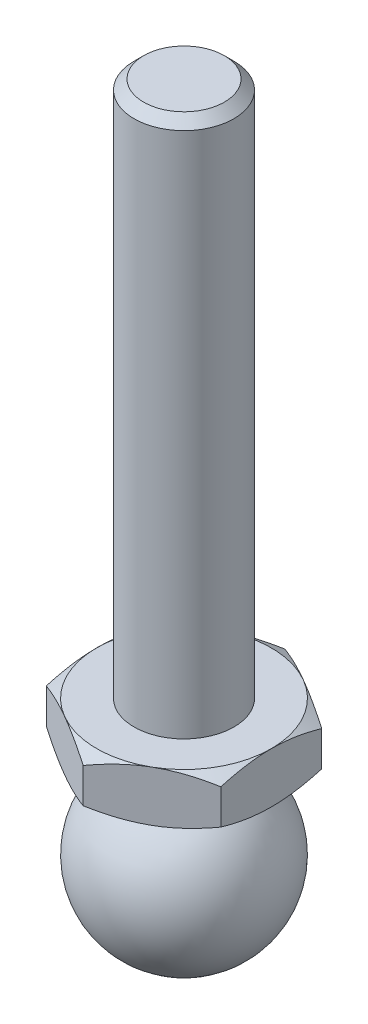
ISO-10303-21;
HEADER;
FILE_DESCRIPTION(('STEP AP214'),'2;1');
FILE_NAME('part.step','',(''),(''),'','','');
FILE_SCHEMA(('AUTOMOTIVE_DESIGN { 1 0 10303 214 1 1 1 1 }'));
ENDSEC;
DATA;
#1=APPLICATION_CONTEXT('core data for automotive mechanical design processes');
#2=APPLICATION_PROTOCOL_DEFINITION('international standard','automotive_design',2000,#1);
#3=PRODUCT_CONTEXT('',#1,'mechanical');
#4=PRODUCT('Part','Part','',(#3));
#5=PRODUCT_RELATED_PRODUCT_CATEGORY('part','',(#4));
#6=PRODUCT_DEFINITION_FORMATION('','',#4);
#7=PRODUCT_DEFINITION_CONTEXT('part definition',#1,'design');
#8=PRODUCT_DEFINITION('design','',#6,#7);
#9=PRODUCT_DEFINITION_SHAPE('','',#8);
#10=(LENGTH_UNIT() NAMED_UNIT(*) SI_UNIT(.MILLI.,.METRE.));
#11=(NAMED_UNIT(*) PLANE_ANGLE_UNIT() SI_UNIT($,.RADIAN.));
#12=(NAMED_UNIT(*) SI_UNIT($,.STERADIAN.) SOLID_ANGLE_UNIT());
#13=UNCERTAINTY_MEASURE_WITH_UNIT(LENGTH_MEASURE(1.E-05),#10,'distance_accuracy_value','');
#14=(GEOMETRIC_REPRESENTATION_CONTEXT(3) GLOBAL_UNCERTAINTY_ASSIGNED_CONTEXT((#13)) GLOBAL_UNIT_ASSIGNED_CONTEXT((#10,
#11,#12)) REPRESENTATION_CONTEXT('',''));
#15=CARTESIAN_POINT('',(0.,0.,0.));
#16=DIRECTION('',(0.,0.,1.));
#17=DIRECTION('',(1.,0.,0.));
#18=AXIS2_PLACEMENT_3D('',#15,#16,#17);
#19=CARTESIAN_POINT('',(0.,10.85,0.));
#20=DIRECTION('',(0.,-1.,0.));
#21=DIRECTION('',(0.,0.,-1.));
#22=AXIS2_PLACEMENT_3D('',#19,#20,#21);
#23=CONICAL_SURFACE('',#22,7.,1.0471975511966);
#24=CARTESIAN_POINT('',(-7.,6.7882826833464,12.1648696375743));
#25=CARTESIAN_POINT('',(-7.,6.93391573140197,11.8738003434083));
#26=CARTESIAN_POINT('',(-7.,7.07854589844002,11.5822239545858));
#27=CARTESIAN_POINT('',(-7.,7.36531569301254,10.997825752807));
#28=CARTESIAN_POINT('',(-7.,7.50745515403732,10.7050038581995));
#29=CARTESIAN_POINT('',(-7.,7.78902214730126,10.117331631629));
#30=CARTESIAN_POINT('',(-7.,7.92844364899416,9.82247840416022));
#31=CARTESIAN_POINT('',(-7.,8.20360604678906,9.23106328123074));
#32=CARTESIAN_POINT('',(-7.,8.33934701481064,8.93450141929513));
#33=CARTESIAN_POINT('',(-7.,8.61231104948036,8.32593520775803));
#34=CARTESIAN_POINT('',(-7.,8.74932547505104,8.01383696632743));
#35=CARTESIAN_POINT('',(-7.,9.01713837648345,7.38695797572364));
#36=CARTESIAN_POINT('',(-7.,9.14793657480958,7.07217710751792));
#37=CARTESIAN_POINT('',(-7.,9.4015530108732,6.4396244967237));
#38=CARTESIAN_POINT('',(-7.,9.52437615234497,6.12185473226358));
#39=CARTESIAN_POINT('',(-7.,9.75990162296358,5.48260317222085));
#40=CARTESIAN_POINT('',(-7.,9.87260505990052,5.16112178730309));
#41=CARTESIAN_POINT('',(-7.,10.1099014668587,4.43821731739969));
#42=CARTESIAN_POINT('',(-7.,10.2311181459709,4.03566892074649));
#43=CARTESIAN_POINT('',(-7.,10.4469740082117,3.22331060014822));
#44=CARTESIAN_POINT('',(-7.,10.5416155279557,2.81350131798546));
#45=CARTESIAN_POINT('',(-7.,10.6569999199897,2.19742561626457));
#46=CARTESIAN_POINT('',(-7.,10.6908518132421,1.99359214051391));
#47=CARTESIAN_POINT('',(-7.,10.7493191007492,1.58461613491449));
#48=CARTESIAN_POINT('',(-7.,10.7739358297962,1.37947379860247));
#49=CARTESIAN_POINT('',(-7.,10.8131968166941,0.96828958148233));
#50=CARTESIAN_POINT('',(-7.,10.8278439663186,0.762247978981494));
#51=CARTESIAN_POINT('',(-7.,10.8467021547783,0.349683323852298));
#52=CARTESIAN_POINT('',(-7.,10.8509132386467,0.143160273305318));
#53=CARTESIAN_POINT('',(-7.,10.8487493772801,-0.271082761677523));
#54=CARTESIAN_POINT('',(-7.,10.8423100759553,-0.478802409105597));
#55=CARTESIAN_POINT('',(-7.,10.8189433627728,-0.893645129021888));
#56=CARTESIAN_POINT('',(-7.,10.8020159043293,-1.10076819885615));
#57=CARTESIAN_POINT('',(-7.,10.7582124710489,-1.514030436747));
#58=CARTESIAN_POINT('',(-7.,10.7313327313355,-1.72016920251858));
#59=CARTESIAN_POINT('',(-7.,10.6684180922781,-2.13103319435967));
#60=CARTESIAN_POINT('',(-7.,10.6323828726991,-2.33575837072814));
#61=CARTESIAN_POINT('',(-7.,10.5105686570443,-2.95437912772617));
#62=CARTESIAN_POINT('',(-7.,10.4118729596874,-3.36575077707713));
#63=CARTESIAN_POINT('',(-7.,10.1884533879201,-4.18138012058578));
#64=CARTESIAN_POINT('',(-7.,10.0637148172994,-4.58563365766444));
#65=CARTESIAN_POINT('',(-7.,9.82332483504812,-5.30320893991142));
#66=CARTESIAN_POINT('',(-7.,9.71128759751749,-5.617759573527));
#67=CARTESIAN_POINT('',(-7.,9.47785144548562,-6.24325021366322));
#68=CARTESIAN_POINT('',(-7.,9.35645511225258,-6.55419118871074));
#69=CARTESIAN_POINT('',(-7.,9.10620704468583,-7.17328528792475));
#70=CARTESIAN_POINT('',(-7.,8.97735033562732,-7.48143638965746));
#71=CARTESIAN_POINT('',(-7.,8.71378231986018,-8.09523802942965));
#72=CARTESIAN_POINT('',(-7.,8.57907065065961,-8.40088841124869));
#73=CARTESIAN_POINT('',(-7.,8.31078407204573,-8.99716345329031));
#74=CARTESIAN_POINT('',(-7.,8.17740317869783,-9.28787568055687));
#75=CARTESIAN_POINT('',(-7.,7.90714715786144,-9.86766295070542));
#76=CARTESIAN_POINT('',(-7.,7.77027208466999,-10.1567380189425));
#77=CARTESIAN_POINT('',(-7.,7.49389786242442,-10.7329937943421));
#78=CARTESIAN_POINT('',(-7.,7.35440383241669,-11.0201769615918));
#79=CARTESIAN_POINT('',(-7.,7.07302286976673,-11.5933594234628));
#80=CARTESIAN_POINT('',(-7.,6.93113600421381,-11.879358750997));
#81=CARTESIAN_POINT('',(-7.,6.7882826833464,-12.1648696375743));
#82=B_SPLINE_CURVE_WITH_KNOTS('',3,(#24,#25,#26,#27,#28,#29,#30,#31,#32,#33,#34,#35,#36,#37,#38,
#39,#40,#41,#42,#43,#44,#45,#46,#47,#48,#49,#50,#51,#52,#53,#54,#55,#56,#57,#58,#59,#60,#61,#62,
#63,#64,#65,#66,#67,#68,#69,#70,#71,#72,#73,#74,#75,#76,#77,#78,#79,#80,#81),.UNSPECIFIED.,.F.,
.F.,(4,2,2,2,2,2,2,2,2,2,2,2,2,2,2,2,2,2,2,2,2,2,2,2,2,2,2,2,4),(0.,0.976413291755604,
1.95289161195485,2.93133423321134,3.90975772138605,4.93225217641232,5.95479223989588,
6.97669748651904,7.99849072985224,9.25906449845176,10.5195273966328,11.1392271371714,
11.7588372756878,12.3782676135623,12.9976952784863,13.6208795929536,14.2440666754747,
14.8674897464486,15.4909346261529,16.7587972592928,18.0273773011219,19.0289263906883,
20.0302002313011,21.0321496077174,22.0341611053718,22.9936838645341,23.9531917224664,
24.9109871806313,25.8687558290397),.UNSPECIFIED.);
#83=CARTESIAN_POINT('',(-7.,10.2247852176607,4.04145188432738));
#84=VERTEX_POINT('',#83);
#85=CARTESIAN_POINT('',(-7.,10.85,0.));
#86=VERTEX_POINT('',#85);
#87=EDGE_CURVE('E309',#84,#86,#82,.T.);
#88=ORIENTED_EDGE('',*,*,#87,.F.);
#89=CARTESIAN_POINT('',(0.00020000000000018,10.2247185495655,8.0830192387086));
#90=CARTESIAN_POINT('',(-0.153667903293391,10.2760001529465,7.99418356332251));
#91=CARTESIAN_POINT('',(-0.30810950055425,10.3249544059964,7.90501666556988));
#92=CARTESIAN_POINT('',(-0.618246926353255,10.4175672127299,7.72595873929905));
#93=CARTESIAN_POINT('',(-0.773943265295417,10.4612234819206,7.63606741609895));
#94=CARTESIAN_POINT('',(-1.24352516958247,10.5833884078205,7.36495417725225));
#95=CARTESIAN_POINT('',(-1.5592643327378,10.652874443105,7.18266208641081));
#96=CARTESIAN_POINT('',(-2.03176224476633,10.7343550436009,6.9098652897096));
#97=CARTESIAN_POINT('',(-2.18710922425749,10.7575665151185,6.82017566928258));
#98=CARTESIAN_POINT('',(-2.49850511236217,10.7964887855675,6.64039116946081));
#99=CARTESIAN_POINT('',(-2.65455395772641,10.8122002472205,6.55029632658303));
#100=CARTESIAN_POINT('',(-2.96692267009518,10.8357220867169,6.3699501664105));
#101=CARTESIAN_POINT('',(-3.12324202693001,10.8435414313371,6.27969914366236));
#102=CARTESIAN_POINT('',(-3.43601650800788,10.8511197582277,6.09911871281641));
#103=CARTESIAN_POINT('',(-3.59247162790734,10.850878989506,6.00878930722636));
#104=CARTESIAN_POINT('',(-4.02110687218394,10.8391402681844,5.76131663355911));
#105=CARTESIAN_POINT('',(-4.2931466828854,10.8194342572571,5.60425437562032));
#106=CARTESIAN_POINT('',(-4.8354194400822,10.7569465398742,5.29117305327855));
#107=CARTESIAN_POINT('',(-5.10565047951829,10.714143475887,5.13515508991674));
#108=CARTESIAN_POINT('',(-5.64901454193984,10.6071483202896,4.82144370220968));
#109=CARTESIAN_POINT('',(-5.92207900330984,10.5425029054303,4.66378986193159));
#110=CARTESIAN_POINT('',(-6.46413578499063,10.395783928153,4.35083323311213));
#111=CARTESIAN_POINT('',(-6.73313504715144,10.3137448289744,4.19552643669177));
#112=CARTESIAN_POINT('',(-7.0002,10.2247185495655,4.04133641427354));
#113=B_SPLINE_CURVE_WITH_KNOTS('',3,(#89,#90,#91,#92,#93,#94,#95,#96,#97,#98,#99,#100,#101,#102,
#103,#104,#105,#106,#107,#108,#109,#110,#111,#112),.UNSPECIFIED.,.F.,.F.,(4,2,2,2,2,2,2,2,2,2,2,
4),(0.,0.554727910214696,1.10969417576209,2.2219327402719,2.76443041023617,3.30688013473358,
3.84871284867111,4.3905288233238,5.33376515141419,6.27787517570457,7.2429241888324,
8.20607866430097),.UNSPECIFIED.);
#114=CARTESIAN_POINT('',(-3.5,10.85,6.06217782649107));
#115=VERTEX_POINT('',#114);
#116=EDGE_CURVE('E135',#115,#84,#113,.T.);
#117=ORIENTED_EDGE('',*,*,#116,.F.);
#118=CARTESIAN_POINT('',(0.,10.85,0.));
#119=DIRECTION('',(0.,-1.,0.));
#120=DIRECTION('',(0.,0.,-1.));
#121=AXIS2_PLACEMENT_3D('',#118,#119,#120);
#122=CIRCLE('',#121,7.);
#123=EDGE_CURVE('E283',#115,#86,#122,.T.);
#124=ORIENTED_EDGE('',*,*,#123,.T.);
#125=EDGE_LOOP('',(#88,#117,#124));
#126=FACE_BOUND('',#125,.T.);
#127=ADVANCED_FACE('F14',(#126),#23,.T.);
#128=CARTESIAN_POINT('',(-7.,10.2247852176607,-4.04145188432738));
#129=VERTEX_POINT('',#128);
#130=EDGE_CURVE('E193',#86,#129,#82,.T.);
#131=ORIENTED_EDGE('',*,*,#130,.F.);
#132=CARTESIAN_POINT('',(-3.5,10.85,-6.06217782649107));
#133=VERTEX_POINT('',#132);
#134=EDGE_CURVE('E195',#86,#133,#122,.T.);
#135=ORIENTED_EDGE('',*,*,#134,.T.);
#136=CARTESIAN_POINT('',(-7.0002,10.2247185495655,-4.04133641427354));
#137=CARTESIAN_POINT('',(-6.84633209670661,10.2760001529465,-4.13017208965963));
#138=CARTESIAN_POINT('',(-6.69189049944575,10.3249544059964,-4.21933898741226));
#139=CARTESIAN_POINT('',(-6.38175307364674,10.4175672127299,-4.39839691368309));
#140=CARTESIAN_POINT('',(-6.22605673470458,10.4612234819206,-4.48828823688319));
#141=CARTESIAN_POINT('',(-5.75647483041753,10.5833884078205,-4.75940147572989));
#142=CARTESIAN_POINT('',(-5.44073566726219,10.652874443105,-4.94169356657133));
#143=CARTESIAN_POINT('',(-4.96823775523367,10.7343550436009,-5.21449036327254));
#144=CARTESIAN_POINT('',(-4.81289077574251,10.7575665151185,-5.30417998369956));
#145=CARTESIAN_POINT('',(-4.50149488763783,10.7964887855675,-5.48396448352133));
#146=CARTESIAN_POINT('',(-4.34544604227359,10.8122002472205,-5.57405932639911));
#147=CARTESIAN_POINT('',(-4.03307732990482,10.8357220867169,-5.75440548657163));
#148=CARTESIAN_POINT('',(-3.87675797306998,10.8435414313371,-5.84465650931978));
#149=CARTESIAN_POINT('',(-3.56398349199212,10.8511197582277,-6.02523694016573));
#150=CARTESIAN_POINT('',(-3.40752837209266,10.850878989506,-6.11556634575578));
#151=CARTESIAN_POINT('',(-2.97889312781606,10.8391402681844,-6.36303901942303));
#152=CARTESIAN_POINT('',(-2.70685331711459,10.8194342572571,-6.52010127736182));
#153=CARTESIAN_POINT('',(-2.1645805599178,10.7569465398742,-6.83318259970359));
#154=CARTESIAN_POINT('',(-1.89434952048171,10.714143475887,-6.9892005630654));
#155=CARTESIAN_POINT('',(-1.35098545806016,10.6071483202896,-7.30291195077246));
#156=CARTESIAN_POINT('',(-1.07792099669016,10.5425029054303,-7.46056579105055));
#157=CARTESIAN_POINT('',(-0.535864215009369,10.395783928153,-7.77352241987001));
#158=CARTESIAN_POINT('',(-0.266864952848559,10.3137448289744,-7.92882921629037));
#159=CARTESIAN_POINT('',(0.000200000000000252,10.2247185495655,-8.0830192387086));
#160=B_SPLINE_CURVE_WITH_KNOTS('',3,(#136,#137,#138,#139,#140,#141,#142,#143,#144,#145,#146,
#147,#148,#149,#150,#151,#152,#153,#154,#155,#156,#157,#158,#159),.UNSPECIFIED.,.F.,.F.,(4,2,2,
2,2,2,2,2,2,2,2,4),(0.,0.554727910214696,1.10969417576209,2.2219327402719,2.76443041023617,
3.30688013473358,3.8487128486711,4.3905288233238,5.33376515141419,6.27787517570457,
7.2429241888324,8.20607866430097),.UNSPECIFIED.);
#161=EDGE_CURVE('E183',#129,#133,#160,.T.);
#162=ORIENTED_EDGE('',*,*,#161,.F.);
#163=EDGE_LOOP('',(#131,#135,#162));
#164=FACE_BOUND('',#163,.T.);
#165=ADVANCED_FACE('F192',(#164),#23,.T.);
#166=CARTESIAN_POINT('',(0.,10.2247852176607,-8.08290376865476));
#167=VERTEX_POINT('',#166);
#168=EDGE_CURVE('E197',#133,#167,#160,.T.);
#169=ORIENTED_EDGE('',*,*,#168,.F.);
#170=CARTESIAN_POINT('',(3.5,10.85,-6.06217782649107));
#171=VERTEX_POINT('',#170);
#172=EDGE_CURVE('E293',#133,#171,#122,.T.);
#173=ORIENTED_EDGE('',*,*,#172,.T.);
#174=CARTESIAN_POINT('',(-0.00020000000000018,10.2247185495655,-8.0830192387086));
#175=CARTESIAN_POINT('',(0.153667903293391,10.2760001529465,-7.99418356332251));
#176=CARTESIAN_POINT('',(0.30810950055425,10.3249544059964,-7.90501666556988));
#177=CARTESIAN_POINT('',(0.618246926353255,10.4175672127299,-7.72595873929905));
#178=CARTESIAN_POINT('',(0.773943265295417,10.4612234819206,-7.63606741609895));
#179=CARTESIAN_POINT('',(1.24352516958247,10.5833884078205,-7.36495417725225));
#180=CARTESIAN_POINT('',(1.5592643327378,10.652874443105,-7.18266208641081));
#181=CARTESIAN_POINT('',(2.03176224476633,10.7343550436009,-6.9098652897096));
#182=CARTESIAN_POINT('',(2.18710922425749,10.7575665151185,-6.82017566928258));
#183=CARTESIAN_POINT('',(2.49850511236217,10.7964887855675,-6.64039116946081));
#184=CARTESIAN_POINT('',(2.65455395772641,10.8122002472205,-6.55029632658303));
#185=CARTESIAN_POINT('',(2.96692267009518,10.8357220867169,-6.3699501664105));
#186=CARTESIAN_POINT('',(3.12324202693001,10.8435414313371,-6.27969914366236));
#187=CARTESIAN_POINT('',(3.43601650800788,10.8511197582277,-6.09911871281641));
#188=CARTESIAN_POINT('',(3.59247162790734,10.850878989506,-6.00878930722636));
#189=CARTESIAN_POINT('',(4.02110687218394,10.8391402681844,-5.76131663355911));
#190=CARTESIAN_POINT('',(4.2931466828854,10.8194342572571,-5.60425437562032));
#191=CARTESIAN_POINT('',(4.8354194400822,10.7569465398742,-5.29117305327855));
#192=CARTESIAN_POINT('',(5.10565047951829,10.714143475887,-5.13515508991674));
#193=CARTESIAN_POINT('',(5.64901454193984,10.6071483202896,-4.82144370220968));
#194=CARTESIAN_POINT('',(5.92207900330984,10.5425029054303,-4.66378986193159));
#195=CARTESIAN_POINT('',(6.46413578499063,10.395783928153,-4.35083323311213));
#196=CARTESIAN_POINT('',(6.73313504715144,10.3137448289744,-4.19552643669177));
#197=CARTESIAN_POINT('',(7.0002,10.2247185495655,-4.04133641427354));
#198=B_SPLINE_CURVE_WITH_KNOTS('',3,(#174,#175,#176,#177,#178,#179,#180,#181,#182,#183,#184,
#185,#186,#187,#188,#189,#190,#191,#192,#193,#194,#195,#196,#197),.UNSPECIFIED.,.F.,.F.,(4,2,2,
2,2,2,2,2,2,2,2,4),(0.,0.554727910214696,1.10969417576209,2.2219327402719,2.76443041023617,
3.30688013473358,3.84871284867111,4.3905288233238,5.33376515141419,6.27787517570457,
7.2429241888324,8.20607866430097),.UNSPECIFIED.);
#199=EDGE_CURVE('E243',#167,#171,#198,.T.);
#200=ORIENTED_EDGE('',*,*,#199,.F.);
#201=EDGE_LOOP('',(#169,#173,#200));
#202=FACE_BOUND('',#201,.T.);
#203=ADVANCED_FACE('F342',(#202),#23,.T.);
#204=CARTESIAN_POINT('',(7.,10.2247852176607,-4.04145188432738));
#205=VERTEX_POINT('',#204);
#206=EDGE_CURVE('E238',#171,#205,#198,.T.);
#207=ORIENTED_EDGE('',*,*,#206,.F.);
#208=CARTESIAN_POINT('',(7.,10.85,0.));
#209=VERTEX_POINT('',#208);
#210=EDGE_CURVE('E288',#171,#209,#122,.T.);
#211=ORIENTED_EDGE('',*,*,#210,.T.);
#212=CARTESIAN_POINT('',(7.,6.7882826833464,-12.1648696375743));
#213=CARTESIAN_POINT('',(7.,6.93391573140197,-11.8738003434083));
#214=CARTESIAN_POINT('',(7.,7.07854589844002,-11.5822239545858));
#215=CARTESIAN_POINT('',(7.,7.36531569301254,-10.997825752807));
#216=CARTESIAN_POINT('',(7.,7.50745515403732,-10.7050038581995));
#217=CARTESIAN_POINT('',(7.,7.78902214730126,-10.117331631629));
#218=CARTESIAN_POINT('',(7.,7.92844364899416,-9.82247840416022));
#219=CARTESIAN_POINT('',(7.,8.20360604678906,-9.23106328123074));
#220=CARTESIAN_POINT('',(7.,8.33934701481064,-8.93450141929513));
#221=CARTESIAN_POINT('',(7.,8.61231104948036,-8.32593520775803));
#222=CARTESIAN_POINT('',(7.,8.74932547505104,-8.01383696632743));
#223=CARTESIAN_POINT('',(7.,9.01713837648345,-7.38695797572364));
#224=CARTESIAN_POINT('',(7.,9.14793657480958,-7.07217710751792));
#225=CARTESIAN_POINT('',(7.,9.4015530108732,-6.4396244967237));
#226=CARTESIAN_POINT('',(7.,9.52437615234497,-6.12185473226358));
#227=CARTESIAN_POINT('',(7.,9.75990162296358,-5.48260317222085));
#228=CARTESIAN_POINT('',(7.,9.87260505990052,-5.16112178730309));
#229=CARTESIAN_POINT('',(7.,10.1099014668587,-4.43821731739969));
#230=CARTESIAN_POINT('',(7.,10.2311181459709,-4.03566892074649));
#231=CARTESIAN_POINT('',(7.,10.4469740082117,-3.22331060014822));
#232=CARTESIAN_POINT('',(7.,10.5416155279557,-2.81350131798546));
#233=CARTESIAN_POINT('',(7.,10.6569999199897,-2.19742561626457));
#234=CARTESIAN_POINT('',(7.,10.6908518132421,-1.99359214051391));
#235=CARTESIAN_POINT('',(7.,10.7493191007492,-1.58461613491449));
#236=CARTESIAN_POINT('',(7.,10.7739358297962,-1.37947379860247));
#237=CARTESIAN_POINT('',(7.,10.8131968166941,-0.96828958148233));
#238=CARTESIAN_POINT('',(7.,10.8278439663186,-0.762247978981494));
#239=CARTESIAN_POINT('',(7.,10.8467021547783,-0.349683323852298));
#240=CARTESIAN_POINT('',(7.,10.8509132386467,-0.143160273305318));
#241=CARTESIAN_POINT('',(7.,10.8487493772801,0.271082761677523));
#242=CARTESIAN_POINT('',(7.,10.8423100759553,0.478802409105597));
#243=CARTESIAN_POINT('',(7.,10.8189433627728,0.893645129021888));
#244=CARTESIAN_POINT('',(7.,10.8020159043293,1.10076819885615));
#245=CARTESIAN_POINT('',(7.,10.7582124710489,1.514030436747));
#246=CARTESIAN_POINT('',(7.,10.7313327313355,1.72016920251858));
#247=CARTESIAN_POINT('',(7.,10.6684180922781,2.13103319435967));
#248=CARTESIAN_POINT('',(7.,10.6323828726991,2.33575837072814));
#249=CARTESIAN_POINT('',(7.,10.5105686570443,2.95437912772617));
#250=CARTESIAN_POINT('',(7.,10.4118729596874,3.36575077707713));
#251=CARTESIAN_POINT('',(7.,10.1884533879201,4.18138012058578));
#252=CARTESIAN_POINT('',(7.,10.0637148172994,4.58563365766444));
#253=CARTESIAN_POINT('',(7.,9.82332483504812,5.30320893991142));
#254=CARTESIAN_POINT('',(7.,9.71128759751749,5.617759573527));
#255=CARTESIAN_POINT('',(7.,9.47785144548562,6.24325021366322));
#256=CARTESIAN_POINT('',(7.,9.35645511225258,6.55419118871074));
#257=CARTESIAN_POINT('',(7.,9.10620704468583,7.17328528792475));
#258=CARTESIAN_POINT('',(7.,8.97735033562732,7.48143638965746));
#259=CARTESIAN_POINT('',(7.,8.71378231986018,8.09523802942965));
#260=CARTESIAN_POINT('',(7.,8.57907065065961,8.40088841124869));
#261=CARTESIAN_POINT('',(7.,8.31078407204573,8.99716345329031));
#262=CARTESIAN_POINT('',(7.,8.17740317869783,9.28787568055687));
#263=CARTESIAN_POINT('',(7.,7.90714715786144,9.86766295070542));
#264=CARTESIAN_POINT('',(7.,7.77027208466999,10.1567380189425));
#265=CARTESIAN_POINT('',(7.,7.49389786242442,10.7329937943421));
#266=CARTESIAN_POINT('',(7.,7.35440383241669,11.0201769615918));
#267=CARTESIAN_POINT('',(7.,7.07302286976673,11.5933594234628));
#268=CARTESIAN_POINT('',(7.,6.93113600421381,11.879358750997));
#269=CARTESIAN_POINT('',(7.,6.7882826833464,12.1648696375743));
#270=B_SPLINE_CURVE_WITH_KNOTS('',3,(#212,#213,#214,#215,#216,#217,#218,#219,#220,#221,#222,
#223,#224,#225,#226,#227,#228,#229,#230,#231,#232,#233,#234,#235,#236,#237,#238,#239,#240,#241,
#242,#243,#244,#245,#246,#247,#248,#249,#250,#251,#252,#253,#254,#255,#256,#257,#258,#259,#260,
#261,#262,#263,#264,#265,#266,#267,#268,#269),.UNSPECIFIED.,.F.,.F.,(4,2,2,2,2,2,2,2,2,2,2,2,2,
2,2,2,2,2,2,2,2,2,2,2,2,2,2,2,4),(0.,0.976413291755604,1.95289161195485,2.93133423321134,
3.90975772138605,4.93225217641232,5.95479223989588,6.97669748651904,7.99849072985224,
9.25906449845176,10.5195273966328,11.1392271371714,11.7588372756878,12.3782676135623,
12.9976952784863,13.6208795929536,14.2440666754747,14.8674897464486,15.4909346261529,
16.7587972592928,18.0273773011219,19.0289263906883,20.0302002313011,21.0321496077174,
22.0341611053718,22.9936838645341,23.9531917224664,24.9109871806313,25.8687558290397),.UNSPECIFIED.);
#271=EDGE_CURVE('E249',#205,#209,#270,.T.);
#272=ORIENTED_EDGE('',*,*,#271,.F.);
#273=EDGE_LOOP('',(#207,#211,#272));
#274=FACE_BOUND('',#273,.T.);
#275=ADVANCED_FACE('F352',(#274),#23,.T.);
#276=CARTESIAN_POINT('',(7.,10.2247852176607,4.04145188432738));
#277=VERTEX_POINT('',#276);
#278=EDGE_CURVE('E251',#209,#277,#270,.T.);
#279=ORIENTED_EDGE('',*,*,#278,.F.);
#280=CARTESIAN_POINT('',(3.5,10.85,6.06217782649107));
#281=VERTEX_POINT('',#280);
#282=EDGE_CURVE('E281',#209,#281,#122,.T.);
#283=ORIENTED_EDGE('',*,*,#282,.T.);
#284=CARTESIAN_POINT('',(7.0002,10.2247185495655,4.04133641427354));
#285=CARTESIAN_POINT('',(6.84633209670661,10.2760001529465,4.13017208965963));
#286=CARTESIAN_POINT('',(6.69189049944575,10.3249544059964,4.21933898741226));
#287=CARTESIAN_POINT('',(6.38175307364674,10.4175672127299,4.39839691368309));
#288=CARTESIAN_POINT('',(6.22605673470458,10.4612234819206,4.48828823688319));
#289=CARTESIAN_POINT('',(5.75647483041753,10.5833884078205,4.75940147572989));
#290=CARTESIAN_POINT('',(5.44073566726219,10.652874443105,4.94169356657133));
#291=CARTESIAN_POINT('',(4.96823775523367,10.7343550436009,5.21449036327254));
#292=CARTESIAN_POINT('',(4.81289077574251,10.7575665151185,5.30417998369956));
#293=CARTESIAN_POINT('',(4.50149488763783,10.7964887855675,5.48396448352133));
#294=CARTESIAN_POINT('',(4.34544604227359,10.8122002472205,5.57405932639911));
#295=CARTESIAN_POINT('',(4.03307732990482,10.8357220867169,5.75440548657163));
#296=CARTESIAN_POINT('',(3.87675797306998,10.8435414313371,5.84465650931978));
#297=CARTESIAN_POINT('',(3.56398349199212,10.8511197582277,6.02523694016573));
#298=CARTESIAN_POINT('',(3.40752837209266,10.850878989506,6.11556634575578));
#299=CARTESIAN_POINT('',(2.97889312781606,10.8391402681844,6.36303901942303));
#300=CARTESIAN_POINT('',(2.70685331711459,10.8194342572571,6.52010127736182));
#301=CARTESIAN_POINT('',(2.1645805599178,10.7569465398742,6.83318259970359));
#302=CARTESIAN_POINT('',(1.89434952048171,10.714143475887,6.9892005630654));
#303=CARTESIAN_POINT('',(1.35098545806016,10.6071483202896,7.30291195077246));
#304=CARTESIAN_POINT('',(1.07792099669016,10.5425029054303,7.46056579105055));
#305=CARTESIAN_POINT('',(0.535864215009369,10.395783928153,7.77352241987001));
#306=CARTESIAN_POINT('',(0.266864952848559,10.3137448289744,7.92882921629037));
#307=CARTESIAN_POINT('',(-0.000200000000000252,10.2247185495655,8.0830192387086));
#308=B_SPLINE_CURVE_WITH_KNOTS('',3,(#284,#285,#286,#287,#288,#289,#290,#291,#292,#293,#294,
#295,#296,#297,#298,#299,#300,#301,#302,#303,#304,#305,#306,#307),.UNSPECIFIED.,.F.,.F.,(4,2,2,
2,2,2,2,2,2,2,2,4),(0.,0.554727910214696,1.10969417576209,2.2219327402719,2.76443041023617,
3.30688013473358,3.8487128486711,4.3905288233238,5.33376515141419,6.27787517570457,
7.2429241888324,8.20607866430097),.UNSPECIFIED.);
#309=EDGE_CURVE('E126',#277,#281,#308,.T.);
#310=ORIENTED_EDGE('',*,*,#309,.F.);
#311=EDGE_LOOP('',(#279,#283,#310));
#312=FACE_BOUND('',#311,.T.);
#313=ADVANCED_FACE('F285',(#312),#23,.T.);
#314=CARTESIAN_POINT('',(0.,10.2247852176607,8.08290376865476));
#315=VERTEX_POINT('',#314);
#316=EDGE_CURVE('E116',#281,#315,#308,.T.);
#317=ORIENTED_EDGE('',*,*,#316,.F.);
#318=EDGE_CURVE('E274',#281,#115,#122,.T.);
#319=ORIENTED_EDGE('',*,*,#318,.T.);
#320=EDGE_CURVE('E29',#315,#115,#113,.T.);
#321=ORIENTED_EDGE('',*,*,#320,.F.);
#322=EDGE_LOOP('',(#317,#319,#321));
#323=FACE_BOUND('',#322,.T.);
#324=ADVANCED_FACE('F273',(#323),#23,.T.);
#325=CARTESIAN_POINT('',(0.,53.85,0.));
#326=DIRECTION('',(0.,-1.,0.));
#327=DIRECTION('',(0.,0.,-1.));
#328=AXIS2_PLACEMENT_3D('',#325,#326,#327);
#329=PLANE('',#328);
#330=CARTESIAN_POINT('',(0.,53.85,0.));
#331=DIRECTION('',(0.,-1.,0.));
#332=DIRECTION('',(0.,0.,-1.));
#333=AXIS2_PLACEMENT_3D('',#330,#331,#332);
#334=CIRCLE('',#333,3.233);
#335=CARTESIAN_POINT('',(0.,53.85,-3.233));
#336=VERTEX_POINT('',#335);
#337=EDGE_CURVE('E22',#336,#336,#334,.T.);
#338=ORIENTED_EDGE('',*,*,#337,.F.);
#339=EDGE_LOOP('',(#338));
#340=FACE_BOUND('',#339,.T.);
#341=ADVANCED_FACE('F16',(#340),#329,.F.);
#342=CARTESIAN_POINT('',(0.,53.85,0.));
#343=DIRECTION('',(0.,-1.,0.));
#344=DIRECTION('',(0.,0.,-1.));
#345=AXIS2_PLACEMENT_3D('',#342,#343,#344);
#346=CONICAL_SURFACE('',#345,3.233,0.785398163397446);
#347=CARTESIAN_POINT('',(0.,53.083,0.));
#348=DIRECTION('',(0.,-1.,0.));
#349=DIRECTION('',(0.,0.,-1.));
#350=AXIS2_PLACEMENT_3D('',#347,#348,#349);
#351=CIRCLE('',#350,4.);
#352=CARTESIAN_POINT('',(0.,53.083,-4.));
#353=VERTEX_POINT('',#352);
#354=EDGE_CURVE('E290',#353,#353,#351,.T.);
#355=ORIENTED_EDGE('',*,*,#354,.F.);
#356=EDGE_LOOP('',(#355));
#357=FACE_BOUND('',#356,.T.);
#358=ORIENTED_EDGE('',*,*,#337,.T.);
#359=EDGE_LOOP('',(#358));
#360=FACE_BOUND('',#359,.T.);
#361=ADVANCED_FACE('F350',(#357,#360),#346,.T.);
#362=CARTESIAN_POINT('',(0.,-7.,0.));
#363=DIRECTION('',(0.,-1.,0.));
#364=DIRECTION('',(0.,0.,-1.));
#365=AXIS2_PLACEMENT_3D('',#362,#363,#364);
#366=CYLINDRICAL_SURFACE('',#365,4.);
#367=CARTESIAN_POINT('',(0.,10.85,0.));
#368=DIRECTION('',(0.,-1.,0.));
#369=DIRECTION('',(0.,0.,-1.));
#370=AXIS2_PLACEMENT_3D('',#367,#368,#369);
#371=CIRCLE('',#370,4.);
#372=CARTESIAN_POINT('',(0.,10.85,-4.));
#373=VERTEX_POINT('',#372);
#374=EDGE_CURVE('E287',#373,#373,#371,.T.);
#375=ORIENTED_EDGE('',*,*,#374,.F.);
#376=EDGE_LOOP('',(#375));
#377=FACE_BOUND('',#376,.T.);
#378=ORIENTED_EDGE('',*,*,#354,.T.);
#379=EDGE_LOOP('',(#378));
#380=FACE_BOUND('',#379,.T.);
#381=ADVANCED_FACE('F427',(#377,#380),#366,.T.);
#382=CARTESIAN_POINT('',(4.,10.85,0.));
#383=DIRECTION('',(0.,-1.,0.));
#384=DIRECTION('',(0.,0.,-1.));
#385=AXIS2_PLACEMENT_3D('',#382,#383,#384);
#386=PLANE('',#385);
#387=ORIENTED_EDGE('',*,*,#282,.F.);
#388=ORIENTED_EDGE('',*,*,#210,.F.);
#389=ORIENTED_EDGE('',*,*,#172,.F.);
#390=ORIENTED_EDGE('',*,*,#134,.F.);
#391=ORIENTED_EDGE('',*,*,#123,.F.);
#392=ORIENTED_EDGE('',*,*,#318,.F.);
#393=EDGE_LOOP('',(#387,#388,#389,#390,#391,#392));
#394=FACE_BOUND('',#393,.T.);
#395=ORIENTED_EDGE('',*,*,#374,.T.);
#396=EDGE_LOOP('',(#395));
#397=FACE_BOUND('',#396,.T.);
#398=ADVANCED_FACE('F278',(#394,#397),#386,.F.);
#399=CARTESIAN_POINT('',(-7.,6.8,-4.04145188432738));
#400=DIRECTION('',(-1.,0.,0.));
#401=DIRECTION('',(0.,0.,1.));
#402=AXIS2_PLACEMENT_3D('',#399,#400,#401);
#403=PLANE('',#402);
#404=ORIENTED_EDGE('',*,*,#87,.T.);
#405=ORIENTED_EDGE('',*,*,#130,.T.);
#406=DIRECTION('',(0.,1.,0.));
#407=VECTOR('',#406,1.);
#408=CARTESIAN_POINT('',(-7.,6.8,-4.04145188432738));
#409=LINE('',#408,#407);
#410=CARTESIAN_POINT('',(-7.,7.42521478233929,-4.04145188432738));
#411=VERTEX_POINT('',#410);
#412=EDGE_CURVE('E109',#411,#129,#409,.T.);
#413=ORIENTED_EDGE('',*,*,#412,.F.);
#414=CARTESIAN_POINT('',(-7.,10.8617173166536,-12.1648696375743));
#415=CARTESIAN_POINT('',(-7.,10.716084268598,-11.8738003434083));
#416=CARTESIAN_POINT('',(-7.,10.57145410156,-11.5822239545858));
#417=CARTESIAN_POINT('',(-7.,10.2846843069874,-10.997825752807));
#418=CARTESIAN_POINT('',(-7.,10.1425448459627,-10.7050038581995));
#419=CARTESIAN_POINT('',(-7.,9.86097785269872,-10.1173316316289));
#420=CARTESIAN_POINT('',(-7.,9.72155635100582,-9.82247840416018));
#421=CARTESIAN_POINT('',(-7.,9.44639395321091,-9.23106328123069));
#422=CARTESIAN_POINT('',(-7.,9.31065298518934,-8.93450141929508));
#423=CARTESIAN_POINT('',(-7.,9.03768895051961,-8.32593520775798));
#424=CARTESIAN_POINT('',(-7.,8.90067452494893,-8.01383696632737));
#425=CARTESIAN_POINT('',(-7.,8.63286162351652,-7.38695797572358));
#426=CARTESIAN_POINT('',(-7.,8.50206342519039,-7.07217710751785));
#427=CARTESIAN_POINT('',(-7.,8.24844698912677,-6.43962449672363));
#428=CARTESIAN_POINT('',(-7.,8.125623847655,-6.12185473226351));
#429=CARTESIAN_POINT('',(-7.,7.8900983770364,-5.48260317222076));
#430=CARTESIAN_POINT('',(-7.,7.77739494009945,-5.16112178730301));
#431=CARTESIAN_POINT('',(-7.,7.54009853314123,-4.4382173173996));
#432=CARTESIAN_POINT('',(-7.,7.41888185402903,-4.03566892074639));
#433=CARTESIAN_POINT('',(-7.,7.20302599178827,-3.22331060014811));
#434=CARTESIAN_POINT('',(-7.,7.10838447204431,-2.81350131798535));
#435=CARTESIAN_POINT('',(-7.,6.99300008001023,-2.19742561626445));
#436=CARTESIAN_POINT('',(-7.,6.95914818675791,-1.99359214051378));
#437=CARTESIAN_POINT('',(-7.,6.90068089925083,-1.58461613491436));
#438=CARTESIAN_POINT('',(-7.,6.8760641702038,-1.37947379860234));
#439=CARTESIAN_POINT('',(-7.,6.83680318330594,-0.968289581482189));
#440=CARTESIAN_POINT('',(-7.,6.82215603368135,-0.76224797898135));
#441=CARTESIAN_POINT('',(-7.,6.80329784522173,-0.349683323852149));
#442=CARTESIAN_POINT('',(-7.,6.79908676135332,-0.143160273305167));
#443=CARTESIAN_POINT('',(-7.,6.80125062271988,0.271082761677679));
#444=CARTESIAN_POINT('',(-7.,6.80768992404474,0.478802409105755));
#445=CARTESIAN_POINT('',(-7.,6.83105663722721,0.893645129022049));
#446=CARTESIAN_POINT('',(-7.,6.84798409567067,1.10076819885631));
#447=CARTESIAN_POINT('',(-7.,6.89178752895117,1.51403043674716));
#448=CARTESIAN_POINT('',(-7.,6.91866726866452,1.72016920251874));
#449=CARTESIAN_POINT('',(-7.,6.98158190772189,2.13103319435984));
#450=CARTESIAN_POINT('',(-7.,7.01761712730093,2.33575837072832));
#451=CARTESIAN_POINT('',(-7.,7.13943134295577,2.95437912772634));
#452=CARTESIAN_POINT('',(-7.,7.23812704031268,3.3657507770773));
#453=CARTESIAN_POINT('',(-7.,7.46154661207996,4.18138012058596));
#454=CARTESIAN_POINT('',(-7.,7.58628518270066,4.58563365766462));
#455=CARTESIAN_POINT('',(-7.,7.82667516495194,5.3032089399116));
#456=CARTESIAN_POINT('',(-7.,7.93871240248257,5.61775957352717));
#457=CARTESIAN_POINT('',(-7.,8.17214855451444,6.24325021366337));
#458=CARTESIAN_POINT('',(-7.,8.29354488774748,6.55419118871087));
#459=CARTESIAN_POINT('',(-7.,8.54379295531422,7.17328528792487));
#460=CARTESIAN_POINT('',(-7.,8.67264966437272,7.48143638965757));
#461=CARTESIAN_POINT('',(-7.,8.93621768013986,8.09523802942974));
#462=CARTESIAN_POINT('',(-7.,9.07092934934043,8.40088841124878));
#463=CARTESIAN_POINT('',(-7.,9.33921592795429,8.99716345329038));
#464=CARTESIAN_POINT('',(-7.,9.47259682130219,9.28787568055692));
#465=CARTESIAN_POINT('',(-7.,9.74285284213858,9.86766295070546));
#466=CARTESIAN_POINT('',(-7.,9.87972791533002,10.1567380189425));
#467=CARTESIAN_POINT('',(-7.,10.1561021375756,10.7329937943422));
#468=CARTESIAN_POINT('',(-7.,10.2955961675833,11.0201769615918));
#469=CARTESIAN_POINT('',(-7.,10.5769771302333,11.5933594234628));
#470=CARTESIAN_POINT('',(-7.,10.7188639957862,11.879358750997));
#471=CARTESIAN_POINT('',(-7.,10.8617173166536,12.1648696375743));
#472=B_SPLINE_CURVE_WITH_KNOTS('',3,(#414,#415,#416,#417,#418,#419,#420,#421,#422,#423,#424,
#425,#426,#427,#428,#429,#430,#431,#432,#433,#434,#435,#436,#437,#438,#439,#440,#441,#442,#443,
#444,#445,#446,#447,#448,#449,#450,#451,#452,#453,#454,#455,#456,#457,#458,#459,#460,#461,#462,
#463,#464,#465,#466,#467,#468,#469,#470,#471),.UNSPECIFIED.,.F.,.F.,(4,2,2,2,2,2,2,2,2,2,2,2,2,
2,2,2,2,2,2,2,2,2,2,2,2,2,2,2,4),(0.,0.976413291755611,1.95289161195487,2.93133423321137,
3.90975772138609,4.93225217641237,5.95479223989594,6.97669748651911,7.99849072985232,
9.25906449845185,10.5195273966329,11.1392271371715,11.7588372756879,12.3782676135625,
12.9976952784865,13.6208795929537,14.2440666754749,14.8674897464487,15.490934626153,
16.758797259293,18.0273773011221,19.0289263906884,20.0302002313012,21.0321496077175,
22.0341611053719,22.9936838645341,23.9531917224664,24.9109871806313,25.8687558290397),.UNSPECIFIED.);
#473=CARTESIAN_POINT('',(-7.,6.8,0.));
#474=VERTEX_POINT('',#473);
#475=EDGE_CURVE('E199',#411,#474,#472,.T.);
#476=ORIENTED_EDGE('',*,*,#475,.T.);
#477=CARTESIAN_POINT('',(-7.,7.42521478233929,4.04145188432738));
#478=VERTEX_POINT('',#477);
#479=EDGE_CURVE('E196',#474,#478,#472,.T.);
#480=ORIENTED_EDGE('',*,*,#479,.T.);
#481=DIRECTION('',(0.,1.,0.));
#482=VECTOR('',#481,1.);
#483=CARTESIAN_POINT('',(-7.,6.8,4.04145188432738));
#484=LINE('',#483,#482);
#485=EDGE_CURVE('E118',#478,#84,#484,.T.);
#486=ORIENTED_EDGE('',*,*,#485,.T.);
#487=EDGE_LOOP('',(#404,#405,#413,#476,#480,#486));
#488=FACE_BOUND('',#487,.T.);
#489=ADVANCED_FACE('F224',(#488),#403,.T.);
#490=CARTESIAN_POINT('',(0.,6.8,-8.08290376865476));
#491=DIRECTION('',(-0.5,0.,-0.866025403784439));
#492=DIRECTION('',(-0.866025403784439,0.,0.5));
#493=AXIS2_PLACEMENT_3D('',#490,#491,#492);
#494=PLANE('',#493);
#495=ORIENTED_EDGE('',*,*,#161,.T.);
#496=ORIENTED_EDGE('',*,*,#168,.T.);
#497=DIRECTION('',(0.,1.,0.));
#498=VECTOR('',#497,1.);
#499=CARTESIAN_POINT('',(0.,6.8,-8.08290376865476));
#500=LINE('',#499,#498);
#501=CARTESIAN_POINT('',(0.,7.42521478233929,-8.08290376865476));
#502=VERTEX_POINT('',#501);
#503=EDGE_CURVE('E175',#502,#167,#500,.T.);
#504=ORIENTED_EDGE('',*,*,#503,.F.);
#505=CARTESIAN_POINT('',(0.000200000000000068,7.42528145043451,-8.0830192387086));
#506=CARTESIAN_POINT('',(-0.153667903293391,7.3739998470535,-7.99418356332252));
#507=CARTESIAN_POINT('',(-0.308109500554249,7.32504559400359,-7.90501666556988));
#508=CARTESIAN_POINT('',(-0.618246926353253,7.23243278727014,-7.72595873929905));
#509=CARTESIAN_POINT('',(-0.773943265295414,7.18877651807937,-7.63606741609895));
#510=CARTESIAN_POINT('',(-1.24352516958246,7.0666115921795,-7.36495417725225));
#511=CARTESIAN_POINT('',(-1.5592643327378,6.99712555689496,-7.18266208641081));
#512=CARTESIAN_POINT('',(-2.03176224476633,6.9156449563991,-6.9098652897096));
#513=CARTESIAN_POINT('',(-2.18710922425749,6.89243348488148,-6.82017566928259));
#514=CARTESIAN_POINT('',(-2.49850511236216,6.85351121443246,-6.64039116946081));
#515=CARTESIAN_POINT('',(-2.65455395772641,6.83779975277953,-6.55029632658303));
#516=CARTESIAN_POINT('',(-2.96692267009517,6.81427791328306,-6.36995016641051));
#517=CARTESIAN_POINT('',(-3.12324202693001,6.80645856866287,-6.27969914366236));
#518=CARTESIAN_POINT('',(-3.43601650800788,6.79888024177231,-6.09911871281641));
#519=CARTESIAN_POINT('',(-3.59247162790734,6.79912101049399,-6.00878930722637));
#520=CARTESIAN_POINT('',(-4.02110687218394,6.8108597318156,-5.76131663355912));
#521=CARTESIAN_POINT('',(-4.2931466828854,6.83056574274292,-5.60425437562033));
#522=CARTESIAN_POINT('',(-4.83541944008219,6.89305346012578,-5.29117305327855));
#523=CARTESIAN_POINT('',(-5.10565047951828,6.93585652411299,-5.13515508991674));
#524=CARTESIAN_POINT('',(-5.64901454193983,7.04285167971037,-4.82144370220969));
#525=CARTESIAN_POINT('',(-5.92207900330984,7.10749709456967,-4.66378986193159));
#526=CARTESIAN_POINT('',(-6.46413578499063,7.25421607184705,-4.35083323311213));
#527=CARTESIAN_POINT('',(-6.73313504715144,7.33625517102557,-4.19552643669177));
#528=CARTESIAN_POINT('',(-7.0002,7.42528145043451,-4.04133641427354));
#529=B_SPLINE_CURVE_WITH_KNOTS('',3,(#505,#506,#507,#508,#509,#510,#511,#512,#513,#514,#515,
#516,#517,#518,#519,#520,#521,#522,#523,#524,#525,#526,#527,#528),.UNSPECIFIED.,.F.,.F.,(4,2,2,
2,2,2,2,2,2,2,2,4),(0.,0.554727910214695,1.10969417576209,2.2219327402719,2.76443041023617,
3.30688013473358,3.8487128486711,4.39052882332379,5.33376515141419,6.27787517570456,
7.2429241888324,8.20607866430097),.UNSPECIFIED.);
#530=CARTESIAN_POINT('',(-3.5,6.8,-6.06217782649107));
#531=VERTEX_POINT('',#530);
#532=EDGE_CURVE('E201',#502,#531,#529,.T.);
#533=ORIENTED_EDGE('',*,*,#532,.T.);
#534=EDGE_CURVE('E186',#531,#411,#529,.T.);
#535=ORIENTED_EDGE('',*,*,#534,.T.);
#536=ORIENTED_EDGE('',*,*,#412,.T.);
#537=EDGE_LOOP('',(#495,#496,#504,#533,#535,#536));
#538=FACE_BOUND('',#537,.T.);
#539=ADVANCED_FACE('F182',(#538),#494,.T.);
#540=CARTESIAN_POINT('',(7.,6.8,-4.04145188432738));
#541=DIRECTION('',(0.5,0.,-0.866025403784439));
#542=DIRECTION('',(-0.866025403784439,0.,-0.5));
#543=AXIS2_PLACEMENT_3D('',#540,#541,#542);
#544=PLANE('',#543);
#545=ORIENTED_EDGE('',*,*,#199,.T.);
#546=ORIENTED_EDGE('',*,*,#206,.T.);
#547=DIRECTION('',(0.,1.,0.));
#548=VECTOR('',#547,1.);
#549=CARTESIAN_POINT('',(7.,6.8,-4.04145188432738));
#550=LINE('',#549,#548);
#551=CARTESIAN_POINT('',(7.,7.42521478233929,-4.04145188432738));
#552=VERTEX_POINT('',#551);
#553=EDGE_CURVE('E172',#552,#205,#550,.T.);
#554=ORIENTED_EDGE('',*,*,#553,.F.);
#555=CARTESIAN_POINT('',(7.0002,7.42528145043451,-4.04133641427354));
#556=CARTESIAN_POINT('',(6.84633209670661,7.37399984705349,-4.13017208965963));
#557=CARTESIAN_POINT('',(6.69189049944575,7.32504559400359,-4.21933898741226));
#558=CARTESIAN_POINT('',(6.38175307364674,7.23243278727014,-4.39839691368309));
#559=CARTESIAN_POINT('',(6.22605673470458,7.18877651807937,-4.48828823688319));
#560=CARTESIAN_POINT('',(5.75647483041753,7.0666115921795,-4.75940147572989));
#561=CARTESIAN_POINT('',(5.4407356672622,6.99712555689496,-4.94169356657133));
#562=CARTESIAN_POINT('',(4.96823775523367,6.9156449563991,-5.21449036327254));
#563=CARTESIAN_POINT('',(4.81289077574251,6.89243348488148,-5.30417998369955));
#564=CARTESIAN_POINT('',(4.50149488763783,6.85351121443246,-5.48396448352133));
#565=CARTESIAN_POINT('',(4.34544604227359,6.83779975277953,-5.57405932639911));
#566=CARTESIAN_POINT('',(4.03307732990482,6.81427791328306,-5.75440548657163));
#567=CARTESIAN_POINT('',(3.87675797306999,6.80645856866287,-5.84465650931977));
#568=CARTESIAN_POINT('',(3.56398349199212,6.79888024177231,-6.02523694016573));
#569=CARTESIAN_POINT('',(3.40752837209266,6.79912101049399,-6.11556634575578));
#570=CARTESIAN_POINT('',(2.97889312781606,6.8108597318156,-6.36303901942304));
#571=CARTESIAN_POINT('',(2.7068533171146,6.83056574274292,-6.52010127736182));
#572=CARTESIAN_POINT('',(2.1645805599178,6.89305346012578,-6.83318259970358));
#573=CARTESIAN_POINT('',(1.89434952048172,6.93585652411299,-6.9892005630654));
#574=CARTESIAN_POINT('',(1.35098545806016,7.04285167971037,-7.30291195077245));
#575=CARTESIAN_POINT('',(1.07792099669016,7.10749709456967,-7.46056579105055));
#576=CARTESIAN_POINT('',(0.535864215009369,7.25421607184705,-7.77352241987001));
#577=CARTESIAN_POINT('',(0.266864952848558,7.33625517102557,-7.92882921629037));
#578=CARTESIAN_POINT('',(-0.000200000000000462,7.42528145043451,-8.0830192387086));
#579=B_SPLINE_CURVE_WITH_KNOTS('',3,(#555,#556,#557,#558,#559,#560,#561,#562,#563,#564,#565,
#566,#567,#568,#569,#570,#571,#572,#573,#574,#575,#576,#577,#578),.UNSPECIFIED.,.F.,.F.,(4,2,2,
2,2,2,2,2,2,2,2,4),(0.,0.554727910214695,1.10969417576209,2.2219327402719,2.76443041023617,
3.30688013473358,3.8487128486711,4.39052882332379,5.33376515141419,6.27787517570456,
7.2429241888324,8.20607866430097),.UNSPECIFIED.);
#580=CARTESIAN_POINT('',(3.5,6.8,-6.06217782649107));
#581=VERTEX_POINT('',#580);
#582=EDGE_CURVE('E244',#552,#581,#579,.T.);
#583=ORIENTED_EDGE('',*,*,#582,.T.);
#584=EDGE_CURVE('E232',#581,#502,#579,.T.);
#585=ORIENTED_EDGE('',*,*,#584,.T.);
#586=ORIENTED_EDGE('',*,*,#503,.T.);
#587=EDGE_LOOP('',(#545,#546,#554,#583,#585,#586));
#588=FACE_BOUND('',#587,.T.);
#589=ADVANCED_FACE('F223',(#588),#544,.T.);
#590=CARTESIAN_POINT('',(7.,6.8,4.04145188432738));
#591=DIRECTION('',(1.,0.,0.));
#592=DIRECTION('',(0.,0.,-1.));
#593=AXIS2_PLACEMENT_3D('',#590,#591,#592);
#594=PLANE('',#593);
#595=ORIENTED_EDGE('',*,*,#271,.T.);
#596=ORIENTED_EDGE('',*,*,#278,.T.);
#597=DIRECTION('',(0.,1.,0.));
#598=VECTOR('',#597,1.);
#599=CARTESIAN_POINT('',(7.,6.8,4.04145188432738));
#600=LINE('',#599,#598);
#601=CARTESIAN_POINT('',(7.,7.42521478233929,4.04145188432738));
#602=VERTEX_POINT('',#601);
#603=EDGE_CURVE('E117',#602,#277,#600,.T.);
#604=ORIENTED_EDGE('',*,*,#603,.F.);
#605=CARTESIAN_POINT('',(7.,10.8617173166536,12.1648696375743));
#606=CARTESIAN_POINT('',(7.,10.716084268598,11.8738003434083));
#607=CARTESIAN_POINT('',(7.,10.57145410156,11.5822239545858));
#608=CARTESIAN_POINT('',(7.,10.2846843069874,10.997825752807));
#609=CARTESIAN_POINT('',(7.,10.1425448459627,10.7050038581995));
#610=CARTESIAN_POINT('',(7.,9.86097785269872,10.1173316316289));
#611=CARTESIAN_POINT('',(7.,9.72155635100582,9.82247840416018));
#612=CARTESIAN_POINT('',(7.,9.44639395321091,9.23106328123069));
#613=CARTESIAN_POINT('',(7.,9.31065298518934,8.93450141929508));
#614=CARTESIAN_POINT('',(7.,9.03768895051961,8.32593520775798));
#615=CARTESIAN_POINT('',(7.,8.90067452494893,8.01383696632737));
#616=CARTESIAN_POINT('',(7.,8.63286162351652,7.38695797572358));
#617=CARTESIAN_POINT('',(7.,8.50206342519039,7.07217710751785));
#618=CARTESIAN_POINT('',(7.,8.24844698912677,6.43962449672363));
#619=CARTESIAN_POINT('',(7.,8.125623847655,6.12185473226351));
#620=CARTESIAN_POINT('',(7.,7.8900983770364,5.48260317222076));
#621=CARTESIAN_POINT('',(7.,7.77739494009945,5.16112178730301));
#622=CARTESIAN_POINT('',(7.,7.54009853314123,4.4382173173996));
#623=CARTESIAN_POINT('',(7.,7.41888185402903,4.03566892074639));
#624=CARTESIAN_POINT('',(7.,7.20302599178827,3.22331060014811));
#625=CARTESIAN_POINT('',(7.,7.10838447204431,2.81350131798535));
#626=CARTESIAN_POINT('',(7.,6.99300008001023,2.19742561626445));
#627=CARTESIAN_POINT('',(7.,6.95914818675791,1.99359214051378));
#628=CARTESIAN_POINT('',(7.,6.90068089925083,1.58461613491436));
#629=CARTESIAN_POINT('',(7.,6.8760641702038,1.37947379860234));
#630=CARTESIAN_POINT('',(7.,6.83680318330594,0.968289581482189));
#631=CARTESIAN_POINT('',(7.,6.82215603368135,0.76224797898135));
#632=CARTESIAN_POINT('',(7.,6.80329784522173,0.349683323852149));
#633=CARTESIAN_POINT('',(7.,6.79908676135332,0.143160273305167));
#634=CARTESIAN_POINT('',(7.,6.80125062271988,-0.271082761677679));
#635=CARTESIAN_POINT('',(7.,6.80768992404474,-0.478802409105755));
#636=CARTESIAN_POINT('',(7.,6.83105663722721,-0.893645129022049));
#637=CARTESIAN_POINT('',(7.,6.84798409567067,-1.10076819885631));
#638=CARTESIAN_POINT('',(7.,6.89178752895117,-1.51403043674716));
#639=CARTESIAN_POINT('',(7.,6.91866726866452,-1.72016920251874));
#640=CARTESIAN_POINT('',(7.,6.98158190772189,-2.13103319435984));
#641=CARTESIAN_POINT('',(7.,7.01761712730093,-2.33575837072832));
#642=CARTESIAN_POINT('',(7.,7.13943134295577,-2.95437912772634));
#643=CARTESIAN_POINT('',(7.,7.23812704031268,-3.3657507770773));
#644=CARTESIAN_POINT('',(7.,7.46154661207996,-4.18138012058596));
#645=CARTESIAN_POINT('',(7.,7.58628518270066,-4.58563365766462));
#646=CARTESIAN_POINT('',(7.,7.82667516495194,-5.3032089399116));
#647=CARTESIAN_POINT('',(7.,7.93871240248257,-5.61775957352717));
#648=CARTESIAN_POINT('',(7.,8.17214855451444,-6.24325021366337));
#649=CARTESIAN_POINT('',(7.,8.29354488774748,-6.55419118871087));
#650=CARTESIAN_POINT('',(7.,8.54379295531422,-7.17328528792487));
#651=CARTESIAN_POINT('',(7.,8.67264966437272,-7.48143638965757));
#652=CARTESIAN_POINT('',(7.,8.93621768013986,-8.09523802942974));
#653=CARTESIAN_POINT('',(7.,9.07092934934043,-8.40088841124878));
#654=CARTESIAN_POINT('',(7.,9.33921592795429,-8.99716345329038));
#655=CARTESIAN_POINT('',(7.,9.47259682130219,-9.28787568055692));
#656=CARTESIAN_POINT('',(7.,9.74285284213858,-9.86766295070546));
#657=CARTESIAN_POINT('',(7.,9.87972791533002,-10.1567380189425));
#658=CARTESIAN_POINT('',(7.,10.1561021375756,-10.7329937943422));
#659=CARTESIAN_POINT('',(7.,10.2955961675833,-11.0201769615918));
#660=CARTESIAN_POINT('',(7.,10.5769771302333,-11.5933594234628));
#661=CARTESIAN_POINT('',(7.,10.7188639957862,-11.879358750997));
#662=CARTESIAN_POINT('',(7.,10.8617173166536,-12.1648696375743));
#663=B_SPLINE_CURVE_WITH_KNOTS('',3,(#605,#606,#607,#608,#609,#610,#611,#612,#613,#614,#615,
#616,#617,#618,#619,#620,#621,#622,#623,#624,#625,#626,#627,#628,#629,#630,#631,#632,#633,#634,
#635,#636,#637,#638,#639,#640,#641,#642,#643,#644,#645,#646,#647,#648,#649,#650,#651,#652,#653,
#654,#655,#656,#657,#658,#659,#660,#661,#662),.UNSPECIFIED.,.F.,.F.,(4,2,2,2,2,2,2,2,2,2,2,2,2,
2,2,2,2,2,2,2,2,2,2,2,2,2,2,2,4),(0.,0.976413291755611,1.95289161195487,2.93133423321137,
3.90975772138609,4.93225217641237,5.95479223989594,6.97669748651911,7.99849072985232,
9.25906449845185,10.5195273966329,11.1392271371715,11.7588372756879,12.3782676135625,
12.9976952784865,13.6208795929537,14.2440666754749,14.8674897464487,15.490934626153,
16.758797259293,18.0273773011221,19.0289263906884,20.0302002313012,21.0321496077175,
22.0341611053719,22.9936838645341,23.9531917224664,24.9109871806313,25.8687558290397),.UNSPECIFIED.);
#664=CARTESIAN_POINT('',(7.,6.8,0.));
#665=VERTEX_POINT('',#664);
#666=EDGE_CURVE('E255',#602,#665,#663,.T.);
#667=ORIENTED_EDGE('',*,*,#666,.T.);
#668=EDGE_CURVE('E260',#665,#552,#663,.T.);
#669=ORIENTED_EDGE('',*,*,#668,.T.);
#670=ORIENTED_EDGE('',*,*,#553,.T.);
#671=EDGE_LOOP('',(#595,#596,#604,#667,#669,#670));
#672=FACE_BOUND('',#671,.T.);
#673=ADVANCED_FACE('F153',(#672),#594,.T.);
#674=CARTESIAN_POINT('',(0.,6.8,8.08290376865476));
#675=DIRECTION('',(0.5,0.,0.866025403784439));
#676=DIRECTION('',(0.866025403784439,0.,-0.5));
#677=AXIS2_PLACEMENT_3D('',#674,#675,#676);
#678=PLANE('',#677);
#679=ORIENTED_EDGE('',*,*,#309,.T.);
#680=ORIENTED_EDGE('',*,*,#316,.T.);
#681=DIRECTION('',(0.,1.,0.));
#682=VECTOR('',#681,1.);
#683=CARTESIAN_POINT('',(0.,6.8,8.08290376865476));
#684=LINE('',#683,#682);
#685=CARTESIAN_POINT('',(0.,7.42521478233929,8.08290376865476));
#686=VERTEX_POINT('',#685);
#687=EDGE_CURVE('E104',#686,#315,#684,.T.);
#688=ORIENTED_EDGE('',*,*,#687,.F.);
#689=CARTESIAN_POINT('',(-0.000200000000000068,7.42528145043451,8.0830192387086));
#690=CARTESIAN_POINT('',(0.153667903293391,7.3739998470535,7.99418356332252));
#691=CARTESIAN_POINT('',(0.308109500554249,7.32504559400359,7.90501666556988));
#692=CARTESIAN_POINT('',(0.618246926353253,7.23243278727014,7.72595873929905));
#693=CARTESIAN_POINT('',(0.773943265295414,7.18877651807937,7.63606741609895));
#694=CARTESIAN_POINT('',(1.24352516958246,7.0666115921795,7.36495417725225));
#695=CARTESIAN_POINT('',(1.5592643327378,6.99712555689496,7.18266208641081));
#696=CARTESIAN_POINT('',(2.03176224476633,6.9156449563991,6.9098652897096));
#697=CARTESIAN_POINT('',(2.18710922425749,6.89243348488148,6.82017566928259));
#698=CARTESIAN_POINT('',(2.49850511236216,6.85351121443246,6.64039116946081));
#699=CARTESIAN_POINT('',(2.65455395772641,6.83779975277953,6.55029632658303));
#700=CARTESIAN_POINT('',(2.96692267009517,6.81427791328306,6.36995016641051));
#701=CARTESIAN_POINT('',(3.12324202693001,6.80645856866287,6.27969914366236));
#702=CARTESIAN_POINT('',(3.43601650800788,6.79888024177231,6.09911871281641));
#703=CARTESIAN_POINT('',(3.59247162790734,6.79912101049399,6.00878930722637));
#704=CARTESIAN_POINT('',(4.02110687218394,6.8108597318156,5.76131663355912));
#705=CARTESIAN_POINT('',(4.2931466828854,6.83056574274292,5.60425437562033));
#706=CARTESIAN_POINT('',(4.83541944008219,6.89305346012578,5.29117305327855));
#707=CARTESIAN_POINT('',(5.10565047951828,6.93585652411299,5.13515508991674));
#708=CARTESIAN_POINT('',(5.64901454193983,7.04285167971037,4.82144370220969));
#709=CARTESIAN_POINT('',(5.92207900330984,7.10749709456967,4.66378986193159));
#710=CARTESIAN_POINT('',(6.46413578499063,7.25421607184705,4.35083323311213));
#711=CARTESIAN_POINT('',(6.73313504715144,7.33625517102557,4.19552643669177));
#712=CARTESIAN_POINT('',(7.0002,7.42528145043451,4.04133641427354));
#713=B_SPLINE_CURVE_WITH_KNOTS('',3,(#689,#690,#691,#692,#693,#694,#695,#696,#697,#698,#699,
#700,#701,#702,#703,#704,#705,#706,#707,#708,#709,#710,#711,#712),.UNSPECIFIED.,.F.,.F.,(4,2,2,
2,2,2,2,2,2,2,2,4),(0.,0.554727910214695,1.10969417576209,2.2219327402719,2.76443041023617,
3.30688013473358,3.8487128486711,4.39052882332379,5.33376515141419,6.27787517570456,
7.2429241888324,8.20607866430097),.UNSPECIFIED.);
#714=CARTESIAN_POINT('',(3.5,6.8,6.06217782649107));
#715=VERTEX_POINT('',#714);
#716=EDGE_CURVE('E113',#686,#715,#713,.T.);
#717=ORIENTED_EDGE('',*,*,#716,.T.);
#718=EDGE_CURVE('E124',#715,#602,#713,.T.);
#719=ORIENTED_EDGE('',*,*,#718,.T.);
#720=ORIENTED_EDGE('',*,*,#603,.T.);
#721=EDGE_LOOP('',(#679,#680,#688,#717,#719,#720));
#722=FACE_BOUND('',#721,.T.);
#723=ADVANCED_FACE('F112',(#722),#678,.T.);
#724=CARTESIAN_POINT('',(-7.,6.8,4.04145188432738));
#725=DIRECTION('',(-0.5,0.,0.866025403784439));
#726=DIRECTION('',(0.866025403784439,0.,0.5));
#727=AXIS2_PLACEMENT_3D('',#724,#725,#726);
#728=PLANE('',#727);
#729=ORIENTED_EDGE('',*,*,#320,.T.);
#730=ORIENTED_EDGE('',*,*,#116,.T.);
#731=ORIENTED_EDGE('',*,*,#485,.F.);
#732=CARTESIAN_POINT('',(-7.0002,7.42528145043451,4.04133641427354));
#733=CARTESIAN_POINT('',(-6.84633209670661,7.37399984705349,4.13017208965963));
#734=CARTESIAN_POINT('',(-6.69189049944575,7.32504559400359,4.21933898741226));
#735=CARTESIAN_POINT('',(-6.38175307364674,7.23243278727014,4.39839691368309));
#736=CARTESIAN_POINT('',(-6.22605673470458,7.18877651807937,4.48828823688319));
#737=CARTESIAN_POINT('',(-5.75647483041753,7.0666115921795,4.75940147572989));
#738=CARTESIAN_POINT('',(-5.4407356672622,6.99712555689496,4.94169356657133));
#739=CARTESIAN_POINT('',(-4.96823775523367,6.9156449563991,5.21449036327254));
#740=CARTESIAN_POINT('',(-4.81289077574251,6.89243348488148,5.30417998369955));
#741=CARTESIAN_POINT('',(-4.50149488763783,6.85351121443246,5.48396448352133));
#742=CARTESIAN_POINT('',(-4.34544604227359,6.83779975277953,5.57405932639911));
#743=CARTESIAN_POINT('',(-4.03307732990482,6.81427791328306,5.75440548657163));
#744=CARTESIAN_POINT('',(-3.87675797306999,6.80645856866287,5.84465650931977));
#745=CARTESIAN_POINT('',(-3.56398349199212,6.79888024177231,6.02523694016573));
#746=CARTESIAN_POINT('',(-3.40752837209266,6.79912101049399,6.11556634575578));
#747=CARTESIAN_POINT('',(-2.97889312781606,6.8108597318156,6.36303901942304));
#748=CARTESIAN_POINT('',(-2.7068533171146,6.83056574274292,6.52010127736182));
#749=CARTESIAN_POINT('',(-2.1645805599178,6.89305346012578,6.83318259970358));
#750=CARTESIAN_POINT('',(-1.89434952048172,6.93585652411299,6.9892005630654));
#751=CARTESIAN_POINT('',(-1.35098545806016,7.04285167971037,7.30291195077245));
#752=CARTESIAN_POINT('',(-1.07792099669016,7.10749709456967,7.46056579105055));
#753=CARTESIAN_POINT('',(-0.535864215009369,7.25421607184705,7.77352241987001));
#754=CARTESIAN_POINT('',(-0.266864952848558,7.33625517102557,7.92882921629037));
#755=CARTESIAN_POINT('',(0.000200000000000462,7.42528145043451,8.0830192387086));
#756=B_SPLINE_CURVE_WITH_KNOTS('',3,(#732,#733,#734,#735,#736,#737,#738,#739,#740,#741,#742,
#743,#744,#745,#746,#747,#748,#749,#750,#751,#752,#753,#754,#755),.UNSPECIFIED.,.F.,.F.,(4,2,2,
2,2,2,2,2,2,2,2,4),(0.,0.554727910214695,1.10969417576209,2.2219327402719,2.76443041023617,
3.30688013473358,3.8487128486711,4.39052882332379,5.33376515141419,6.27787517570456,
7.2429241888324,8.20607866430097),.UNSPECIFIED.);
#757=CARTESIAN_POINT('',(-3.5,6.8,6.06217782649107));
#758=VERTEX_POINT('',#757);
#759=EDGE_CURVE('E36',#478,#758,#756,.T.);
#760=ORIENTED_EDGE('',*,*,#759,.T.);
#761=EDGE_CURVE('E101',#758,#686,#756,.T.);
#762=ORIENTED_EDGE('',*,*,#761,.T.);
#763=ORIENTED_EDGE('',*,*,#687,.T.);
#764=EDGE_LOOP('',(#729,#730,#731,#760,#762,#763));
#765=FACE_BOUND('',#764,.T.);
#766=ADVANCED_FACE('F103',(#765),#728,.T.);
#767=CARTESIAN_POINT('',(0.,0.,0.));
#768=DIRECTION('',(0.,-1.,0.));
#769=DIRECTION('',(-1.,0.,0.));
#770=AXIS2_PLACEMENT_3D('',#767,#768,#769);
#771=SPHERICAL_SURFACE('',#770,7.);
#772=CARTESIAN_POINT('',(0.,5.74456264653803,0.));
#773=DIRECTION('',(0.,-1.,0.));
#774=DIRECTION('',(0.,0.,-1.));
#775=AXIS2_PLACEMENT_3D('',#772,#773,#774);
#776=CIRCLE('',#775,4.);
#777=CARTESIAN_POINT('',(0.,5.74456264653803,-4.));
#778=VERTEX_POINT('',#777);
#779=EDGE_CURVE('E9',#778,#778,#776,.F.);
#780=ORIENTED_EDGE('',*,*,#779,.F.);
#781=EDGE_LOOP('',(#780));
#782=FACE_BOUND('',#781,.T.);
#783=ADVANCED_FACE('F160',(#782),#771,.T.);
#784=CARTESIAN_POINT('',(0.,-7.,0.));
#785=DIRECTION('',(0.,-1.,0.));
#786=DIRECTION('',(0.,0.,-1.));
#787=AXIS2_PLACEMENT_3D('',#784,#785,#786);
#788=CYLINDRICAL_SURFACE('',#787,4.);
#789=ORIENTED_EDGE('',*,*,#779,.T.);
#790=EDGE_LOOP('',(#789));
#791=FACE_BOUND('',#790,.T.);
#792=CARTESIAN_POINT('',(0.,6.8,0.));
#793=DIRECTION('',(0.,-1.,0.));
#794=DIRECTION('',(0.,0.,-1.));
#795=AXIS2_PLACEMENT_3D('',#792,#793,#794);
#796=CIRCLE('',#795,4.);
#797=CARTESIAN_POINT('',(0.,6.8,-4.));
#798=VERTEX_POINT('',#797);
#799=EDGE_CURVE('E304',#798,#798,#796,.T.);
#800=ORIENTED_EDGE('',*,*,#799,.T.);
#801=EDGE_LOOP('',(#800));
#802=FACE_BOUND('',#801,.T.);
#803=ADVANCED_FACE('F369',(#791,#802),#788,.T.);
#804=CARTESIAN_POINT('',(0.,7.60829037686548,0.));
#805=DIRECTION('',(0.,1.,0.));
#806=DIRECTION('',(0.,0.,1.));
#807=AXIS2_PLACEMENT_3D('',#804,#805,#806);
#808=CONICAL_SURFACE('',#807,8.4,1.0471975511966);
#809=ORIENTED_EDGE('',*,*,#582,.F.);
#810=ORIENTED_EDGE('',*,*,#668,.F.);
#811=CARTESIAN_POINT('',(0.,6.8,0.));
#812=DIRECTION('',(0.,-1.,0.));
#813=DIRECTION('',(0.,0.,-1.));
#814=AXIS2_PLACEMENT_3D('',#811,#812,#813);
#815=CIRCLE('',#814,7.);
#816=EDGE_CURVE('E297',#581,#665,#815,.T.);
#817=ORIENTED_EDGE('',*,*,#816,.F.);
#818=EDGE_LOOP('',(#809,#810,#817));
#819=FACE_BOUND('',#818,.T.);
#820=ADVANCED_FACE('F147',(#819),#808,.T.);
#821=ORIENTED_EDGE('',*,*,#584,.F.);
#822=EDGE_CURVE('E303',#531,#581,#815,.T.);
#823=ORIENTED_EDGE('',*,*,#822,.F.);
#824=ORIENTED_EDGE('',*,*,#532,.F.);
#825=EDGE_LOOP('',(#821,#823,#824));
#826=FACE_BOUND('',#825,.T.);
#827=ADVANCED_FACE('F366',(#826),#808,.T.);
#828=ORIENTED_EDGE('',*,*,#534,.F.);
#829=EDGE_CURVE('E307',#474,#531,#815,.T.);
#830=ORIENTED_EDGE('',*,*,#829,.F.);
#831=ORIENTED_EDGE('',*,*,#475,.F.);
#832=EDGE_LOOP('',(#828,#830,#831));
#833=FACE_BOUND('',#832,.T.);
#834=ADVANCED_FACE('F323',(#833),#808,.T.);
#835=ORIENTED_EDGE('',*,*,#479,.F.);
#836=EDGE_CURVE('E301',#758,#474,#815,.T.);
#837=ORIENTED_EDGE('',*,*,#836,.F.);
#838=ORIENTED_EDGE('',*,*,#759,.F.);
#839=EDGE_LOOP('',(#835,#837,#838));
#840=FACE_BOUND('',#839,.T.);
#841=ADVANCED_FACE('F320',(#840),#808,.T.);
#842=ORIENTED_EDGE('',*,*,#666,.F.);
#843=ORIENTED_EDGE('',*,*,#718,.F.);
#844=EDGE_CURVE('E294',#665,#715,#815,.T.);
#845=ORIENTED_EDGE('',*,*,#844,.F.);
#846=EDGE_LOOP('',(#842,#843,#845));
#847=FACE_BOUND('',#846,.T.);
#848=ADVANCED_FACE('F327',(#847),#808,.T.);
#849=CARTESIAN_POINT('',(7.,6.8,0.));
#850=DIRECTION('',(0.,1.,0.));
#851=DIRECTION('',(0.,0.,1.));
#852=AXIS2_PLACEMENT_3D('',#849,#850,#851);
#853=PLANE('',#852);
#854=ORIENTED_EDGE('',*,*,#799,.F.);
#855=EDGE_LOOP('',(#854));
#856=FACE_BOUND('',#855,.T.);
#857=ORIENTED_EDGE('',*,*,#816,.T.);
#858=ORIENTED_EDGE('',*,*,#844,.T.);
#859=EDGE_CURVE('E122',#715,#758,#815,.T.);
#860=ORIENTED_EDGE('',*,*,#859,.T.);
#861=ORIENTED_EDGE('',*,*,#836,.T.);
#862=ORIENTED_EDGE('',*,*,#829,.T.);
#863=ORIENTED_EDGE('',*,*,#822,.T.);
#864=EDGE_LOOP('',(#857,#858,#860,#861,#862,#863));
#865=FACE_BOUND('',#864,.T.);
#866=ADVANCED_FACE('F325',(#856,#865),#853,.F.);
#867=ORIENTED_EDGE('',*,*,#716,.F.);
#868=ORIENTED_EDGE('',*,*,#761,.F.);
#869=ORIENTED_EDGE('',*,*,#859,.F.);
#870=EDGE_LOOP('',(#867,#868,#869));
#871=FACE_BOUND('',#870,.T.);
#872=ADVANCED_FACE('F120',(#871),#808,.T.);
#873=CLOSED_SHELL('',(#127,#165,#203,#275,#313,#324,#341,#361,#381,#398,#489,#539,#589,#673,
#723,#766,#783,#803,#820,#827,#834,#841,#848,#866,#872));
#874=MANIFOLD_SOLID_BREP('B1',#873);
#875=ADVANCED_BREP_SHAPE_REPRESENTATION('',(#18,#874),#14);
#876=SHAPE_DEFINITION_REPRESENTATION(#9,#875);
ENDSEC;
END-ISO-10303-21;
